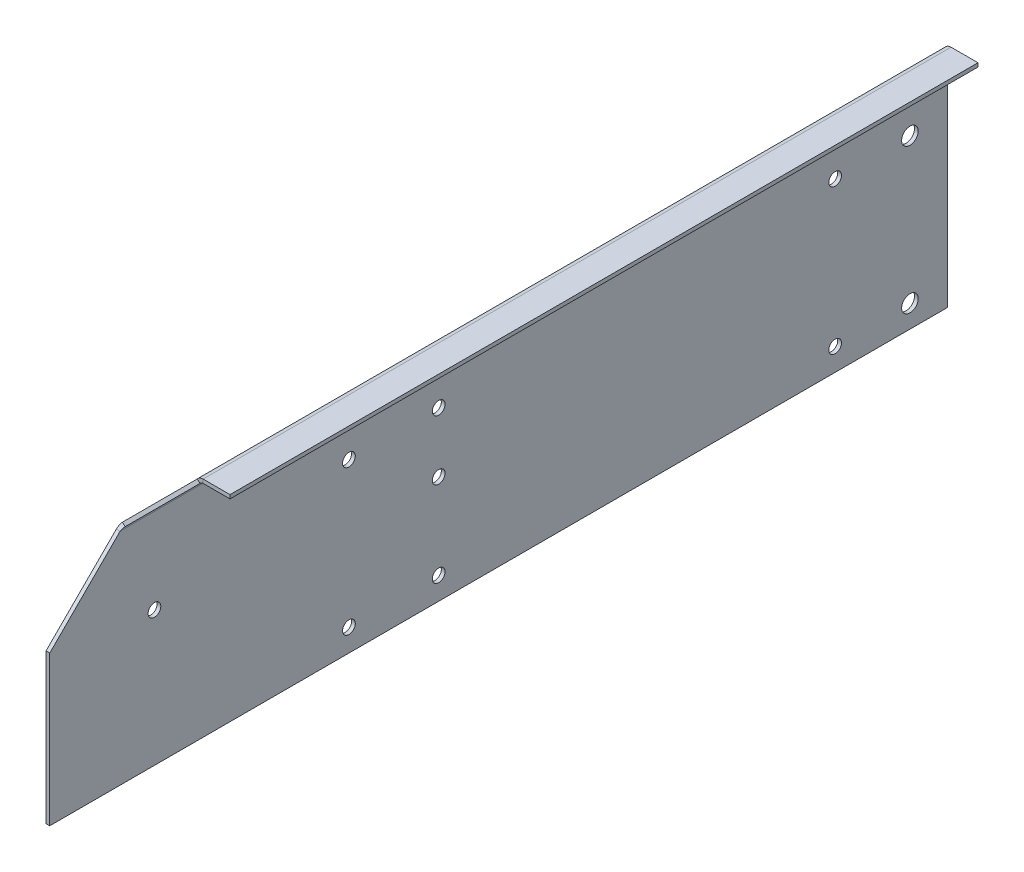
ISO-10303-21;
HEADER;
FILE_DESCRIPTION(('STEP AP214'),'2;1');
FILE_NAME('part.step','',(''),(''),'','','');
FILE_SCHEMA(('AUTOMOTIVE_DESIGN { 1 0 10303 214 1 1 1 1 }'));
ENDSEC;
DATA;
#1=APPLICATION_CONTEXT('core data for automotive mechanical design processes');
#2=APPLICATION_PROTOCOL_DEFINITION('international standard','automotive_design',2000,#1);
#3=PRODUCT_CONTEXT('',#1,'mechanical');
#4=PRODUCT('Part','Part','',(#3));
#5=PRODUCT_RELATED_PRODUCT_CATEGORY('part','',(#4));
#6=PRODUCT_DEFINITION_FORMATION('','',#4);
#7=PRODUCT_DEFINITION_CONTEXT('part definition',#1,'design');
#8=PRODUCT_DEFINITION('design','',#6,#7);
#9=PRODUCT_DEFINITION_SHAPE('','',#8);
#10=(LENGTH_UNIT() NAMED_UNIT(*) SI_UNIT(.MILLI.,.METRE.));
#11=(NAMED_UNIT(*) PLANE_ANGLE_UNIT() SI_UNIT($,.RADIAN.));
#12=(NAMED_UNIT(*) SI_UNIT($,.STERADIAN.) SOLID_ANGLE_UNIT());
#13=UNCERTAINTY_MEASURE_WITH_UNIT(LENGTH_MEASURE(1.E-05),#10,'distance_accuracy_value','');
#14=(GEOMETRIC_REPRESENTATION_CONTEXT(3) GLOBAL_UNCERTAINTY_ASSIGNED_CONTEXT((#13)) GLOBAL_UNIT_ASSIGNED_CONTEXT((#10,
#11,#12)) REPRESENTATION_CONTEXT('',''));
#15=CARTESIAN_POINT('',(0.,0.,0.));
#16=DIRECTION('',(0.,0.,1.));
#17=DIRECTION('',(1.,0.,0.));
#18=AXIS2_PLACEMENT_3D('',#15,#16,#17);
#19=CARTESIAN_POINT('',(5.,147.,300.));
#20=DIRECTION('',(0.,0.,-1.));
#21=DIRECTION('',(-1.,0.,0.));
#22=AXIS2_PLACEMENT_3D('',#19,#20,#21);
#23=CYLINDRICAL_SURFACE('',#22,5.);
#24=DIRECTION('',(0.,0.,-1.));
#25=VECTOR('',#24,1.);
#26=CARTESIAN_POINT('',(0.,147.,300.));
#27=LINE('',#26,#25);
#28=CARTESIAN_POINT('',(0.,147.,253.));
#29=VERTEX_POINT('',#28);
#30=CARTESIAN_POINT('',(0.,147.,-300.));
#31=VERTEX_POINT('',#30);
#32=EDGE_CURVE('E175',#29,#31,#27,.T.);
#33=ORIENTED_EDGE('',*,*,#32,.F.);
#34=CARTESIAN_POINT('',(5.,147.,253.));
#35=DIRECTION('',(0.,-0.707106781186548,-0.707106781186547));
#36=DIRECTION('',(0.,0.707106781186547,-0.707106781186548));
#37=AXIS2_PLACEMENT_3D('',#34,#35,#36);
#38=ELLIPSE('',#37,7.07106781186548,5.);
#39=CARTESIAN_POINT('',(0.999999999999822,150.,250.));
#40=VERTEX_POINT('',#39);
#41=EDGE_CURVE('E188',#40,#29,#38,.F.);
#42=ORIENTED_EDGE('',*,*,#41,.F.);
#43=DIRECTION('',(0.,0.,-1.));
#44=VECTOR('',#43,1.);
#45=CARTESIAN_POINT('',(0.999999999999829,150.,300.));
#46=LINE('',#45,#44);
#47=CARTESIAN_POINT('',(0.999999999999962,150.,200.));
#48=VERTEX_POINT('',#47);
#49=EDGE_CURVE('E291',#48,#40,#46,.F.);
#50=ORIENTED_EDGE('',*,*,#49,.F.);
#51=CARTESIAN_POINT('',(5.,147.,200.));
#52=DIRECTION('',(0.,0.,-1.));
#53=DIRECTION('',(-1.,0.,0.));
#54=AXIS2_PLACEMENT_3D('',#51,#52,#53);
#55=CIRCLE('',#54,5.);
#56=CARTESIAN_POINT('',(5.,152.,200.));
#57=VERTEX_POINT('',#56);
#58=EDGE_CURVE('E301',#57,#48,#55,.F.);
#59=ORIENTED_EDGE('',*,*,#58,.F.);
#60=DIRECTION('',(0.,0.,-1.));
#61=VECTOR('',#60,1.);
#62=CARTESIAN_POINT('',(5.00000000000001,152.,300.));
#63=LINE('',#62,#61);
#64=CARTESIAN_POINT('',(5.00000000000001,152.,-300.));
#65=VERTEX_POINT('',#64);
#66=EDGE_CURVE('E178',#57,#65,#63,.T.);
#67=ORIENTED_EDGE('',*,*,#66,.T.);
#68=CARTESIAN_POINT('',(5.,147.,-300.));
#69=DIRECTION('',(0.,0.,1.));
#70=DIRECTION('',(1.,0.,0.));
#71=AXIS2_PLACEMENT_3D('',#68,#69,#70);
#72=CIRCLE('',#71,5.);
#73=EDGE_CURVE('E122',#31,#65,#72,.F.);
#74=ORIENTED_EDGE('',*,*,#73,.F.);
#75=EDGE_LOOP('',(#33,#42,#50,#59,#67,#74));
#76=FACE_BOUND('',#75,.T.);
#77=ADVANCED_FACE('F40',(#76),#23,.T.);
#78=CARTESIAN_POINT('',(5.,147.,300.));
#79=DIRECTION('',(0.,0.,-1.));
#80=DIRECTION('',(-1.,0.,0.));
#81=AXIS2_PLACEMENT_3D('',#78,#79,#80);
#82=CYLINDRICAL_SURFACE('',#81,2.5);
#83=CARTESIAN_POINT('',(5.,147.,253.));
#84=DIRECTION('',(0.,-0.894427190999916,-0.447213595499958));
#85=DIRECTION('',(0.,0.447213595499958,-0.894427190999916));
#86=AXIS2_PLACEMENT_3D('',#83,#84,#85);
#87=ELLIPSE('',#86,5.59016994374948,2.5);
#88=CARTESIAN_POINT('',(2.99999999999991,148.5,250.));
#89=VERTEX_POINT('',#88);
#90=CARTESIAN_POINT('',(2.5,147.,253.));
#91=VERTEX_POINT('',#90);
#92=EDGE_CURVE('E58',#89,#91,#87,.F.);
#93=ORIENTED_EDGE('',*,*,#92,.T.);
#94=DIRECTION('',(0.,0.,-1.));
#95=VECTOR('',#94,1.);
#96=CARTESIAN_POINT('',(2.5,147.,300.));
#97=LINE('',#96,#95);
#98=CARTESIAN_POINT('',(2.5,147.,-300.));
#99=VERTEX_POINT('',#98);
#100=EDGE_CURVE('E112',#91,#99,#97,.T.);
#101=ORIENTED_EDGE('',*,*,#100,.T.);
#102=CARTESIAN_POINT('',(5.,147.,-300.));
#103=DIRECTION('',(0.,0.,1.));
#104=DIRECTION('',(1.,0.,0.));
#105=AXIS2_PLACEMENT_3D('',#102,#103,#104);
#106=CIRCLE('',#105,2.5);
#107=CARTESIAN_POINT('',(5.,149.5,-300.));
#108=VERTEX_POINT('',#107);
#109=EDGE_CURVE('E120',#99,#108,#106,.F.);
#110=ORIENTED_EDGE('',*,*,#109,.T.);
#111=DIRECTION('',(0.,0.,-1.));
#112=VECTOR('',#111,1.);
#113=CARTESIAN_POINT('',(5.,149.5,300.));
#114=LINE('',#113,#112);
#115=CARTESIAN_POINT('',(5.,149.5,200.));
#116=VERTEX_POINT('',#115);
#117=EDGE_CURVE('E99',#116,#108,#114,.T.);
#118=ORIENTED_EDGE('',*,*,#117,.F.);
#119=CARTESIAN_POINT('',(5.,147.,200.));
#120=DIRECTION('',(0.,0.,-1.));
#121=DIRECTION('',(-1.,0.,0.));
#122=AXIS2_PLACEMENT_3D('',#119,#120,#121);
#123=CIRCLE('',#122,2.5);
#124=CARTESIAN_POINT('',(2.99999999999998,148.5,200.));
#125=VERTEX_POINT('',#124);
#126=EDGE_CURVE('E302',#116,#125,#123,.F.);
#127=ORIENTED_EDGE('',*,*,#126,.T.);
#128=DIRECTION('',(0.,0.,-1.));
#129=VECTOR('',#128,1.);
#130=CARTESIAN_POINT('',(2.99999999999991,148.5,300.));
#131=LINE('',#130,#129);
#132=EDGE_CURVE('E290',#125,#89,#131,.F.);
#133=ORIENTED_EDGE('',*,*,#132,.T.);
#134=EDGE_LOOP('',(#93,#101,#110,#118,#127,#133));
#135=FACE_BOUND('',#134,.T.);
#136=ADVANCED_FACE('F129',(#135),#82,.F.);
#137=CARTESIAN_POINT('',(0.,0.,300.));
#138=DIRECTION('',(-1.,0.,0.));
#139=DIRECTION('',(0.,0.,1.));
#140=AXIS2_PLACEMENT_3D('',#137,#138,#139);
#141=PLANE('',#140);
#142=CARTESIAN_POINT('',(0.,15.,-275.));
#143=DIRECTION('',(-1.,0.,0.));
#144=DIRECTION('',(0.,0.,1.));
#145=AXIS2_PLACEMENT_3D('',#142,#143,#144);
#146=CIRCLE('',#145,5.54999999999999);
#147=CARTESIAN_POINT('',(0.,15.,-269.45));
#148=VERTEX_POINT('',#147);
#149=EDGE_CURVE('E205',#148,#148,#146,.T.);
#150=ORIENTED_EDGE('',*,*,#149,.F.);
#151=EDGE_LOOP('',(#150));
#152=FACE_BOUND('',#151,.T.);
#153=CARTESIAN_POINT('',(0.,112.,-275.));
#154=DIRECTION('',(-1.,0.,0.));
#155=DIRECTION('',(0.,0.,1.));
#156=AXIS2_PLACEMENT_3D('',#153,#154,#155);
#157=CIRCLE('',#156,5.54999999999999);
#158=CARTESIAN_POINT('',(0.,112.,-269.45));
#159=VERTEX_POINT('',#158);
#160=EDGE_CURVE('E189',#159,#159,#157,.T.);
#161=ORIENTED_EDGE('',*,*,#160,.F.);
#162=EDGE_LOOP('',(#161));
#163=FACE_BOUND('',#162,.T.);
#164=CARTESIAN_POINT('',(0.,90.,230.));
#165=DIRECTION('',(-1.,0.,0.));
#166=DIRECTION('',(0.,0.,1.));
#167=AXIS2_PLACEMENT_3D('',#164,#165,#166);
#168=CIRCLE('',#167,4.25000000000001);
#169=CARTESIAN_POINT('',(0.,90.,234.25));
#170=VERTEX_POINT('',#169);
#171=EDGE_CURVE('E282',#170,#170,#168,.T.);
#172=ORIENTED_EDGE('',*,*,#171,.F.);
#173=EDGE_LOOP('',(#172));
#174=FACE_BOUND('',#173,.T.);
#175=CARTESIAN_POINT('',(0.,72.,40.));
#176=DIRECTION('',(-1.,0.,0.));
#177=DIRECTION('',(0.,0.,1.));
#178=AXIS2_PLACEMENT_3D('',#175,#176,#177);
#179=CIRCLE('',#178,4.25000000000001);
#180=CARTESIAN_POINT('',(0.,72.,44.25));
#181=VERTEX_POINT('',#180);
#182=EDGE_CURVE('E274',#181,#181,#179,.T.);
#183=ORIENTED_EDGE('',*,*,#182,.F.);
#184=EDGE_LOOP('',(#183));
#185=FACE_BOUND('',#184,.T.);
#186=CARTESIAN_POINT('',(0.,15.,100.));
#187=DIRECTION('',(-1.,0.,0.));
#188=DIRECTION('',(0.,0.,1.));
#189=AXIS2_PLACEMENT_3D('',#186,#187,#188);
#190=CIRCLE('',#189,4.25);
#191=CARTESIAN_POINT('',(0.,15.,104.25));
#192=VERTEX_POINT('',#191);
#193=EDGE_CURVE('E266',#192,#192,#190,.T.);
#194=ORIENTED_EDGE('',*,*,#193,.F.);
#195=EDGE_LOOP('',(#194));
#196=FACE_BOUND('',#195,.T.);
#197=CARTESIAN_POINT('',(0.,15.,-225.));
#198=DIRECTION('',(-1.,0.,0.));
#199=DIRECTION('',(0.,0.,1.));
#200=AXIS2_PLACEMENT_3D('',#197,#198,#199);
#201=CIRCLE('',#200,4.24999999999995);
#202=CARTESIAN_POINT('',(0.,15.,-220.75));
#203=VERTEX_POINT('',#202);
#204=EDGE_CURVE('E258',#203,#203,#201,.T.);
#205=ORIENTED_EDGE('',*,*,#204,.F.);
#206=EDGE_LOOP('',(#205));
#207=FACE_BOUND('',#206,.T.);
#208=CARTESIAN_POINT('',(0.,112.,40.));
#209=DIRECTION('',(-1.,0.,0.));
#210=DIRECTION('',(0.,0.,1.));
#211=AXIS2_PLACEMENT_3D('',#208,#209,#210);
#212=CIRCLE('',#211,4.25000000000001);
#213=CARTESIAN_POINT('',(0.,112.,44.25));
#214=VERTEX_POINT('',#213);
#215=EDGE_CURVE('E250',#214,#214,#212,.T.);
#216=ORIENTED_EDGE('',*,*,#215,.F.);
#217=EDGE_LOOP('',(#216));
#218=FACE_BOUND('',#217,.T.);
#219=CARTESIAN_POINT('',(0.,15.,40.));
#220=DIRECTION('',(-1.,0.,0.));
#221=DIRECTION('',(0.,0.,1.));
#222=AXIS2_PLACEMENT_3D('',#219,#220,#221);
#223=CIRCLE('',#222,4.25);
#224=CARTESIAN_POINT('',(0.,15.,44.25));
#225=VERTEX_POINT('',#224);
#226=EDGE_CURVE('E243',#225,#225,#223,.T.);
#227=ORIENTED_EDGE('',*,*,#226,.F.);
#228=EDGE_LOOP('',(#227));
#229=FACE_BOUND('',#228,.T.);
#230=CARTESIAN_POINT('',(0.,112.,-225.));
#231=DIRECTION('',(-1.,0.,0.));
#232=DIRECTION('',(0.,0.,1.));
#233=AXIS2_PLACEMENT_3D('',#230,#231,#232);
#234=CIRCLE('',#233,4.24999999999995);
#235=CARTESIAN_POINT('',(0.,112.,-220.75));
#236=VERTEX_POINT('',#235);
#237=EDGE_CURVE('E235',#236,#236,#234,.T.);
#238=ORIENTED_EDGE('',*,*,#237,.F.);
#239=EDGE_LOOP('',(#238));
#240=FACE_BOUND('',#239,.T.);
#241=CARTESIAN_POINT('',(0.,112.,100.));
#242=DIRECTION('',(-1.,0.,0.));
#243=DIRECTION('',(0.,0.,1.));
#244=AXIS2_PLACEMENT_3D('',#241,#242,#243);
#245=CIRCLE('',#244,4.25000000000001);
#246=CARTESIAN_POINT('',(0.,112.,104.25));
#247=VERTEX_POINT('',#246);
#248=EDGE_CURVE('E224',#247,#247,#245,.T.);
#249=ORIENTED_EDGE('',*,*,#248,.F.);
#250=EDGE_LOOP('',(#249));
#251=FACE_BOUND('',#250,.T.);
#252=DIRECTION('',(0.,1.,0.));
#253=VECTOR('',#252,1.);
#254=CARTESIAN_POINT('',(0.,0.,300.));
#255=LINE('',#254,#253);
#256=CARTESIAN_POINT('',(0.,0.,300.));
#257=VERTEX_POINT('',#256);
#258=CARTESIAN_POINT('',(0.,99.9999999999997,300.));
#259=VERTEX_POINT('',#258);
#260=EDGE_CURVE('E132',#257,#259,#255,.T.);
#261=ORIENTED_EDGE('',*,*,#260,.T.);
#262=DIRECTION('',(0.,-0.707106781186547,0.707106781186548));
#263=VECTOR('',#262,1.);
#264=CARTESIAN_POINT('',(0.,49.9999999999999,350.));
#265=LINE('',#264,#263);
#266=EDGE_CURVE('E213',#29,#259,#265,.T.);
#267=ORIENTED_EDGE('',*,*,#266,.F.);
#268=ORIENTED_EDGE('',*,*,#32,.T.);
#269=DIRECTION('',(0.,1.,0.));
#270=VECTOR('',#269,1.);
#271=CARTESIAN_POINT('',(0.,0.,-300.));
#272=LINE('',#271,#270);
#273=CARTESIAN_POINT('',(0.,0.,-300.));
#274=VERTEX_POINT('',#273);
#275=EDGE_CURVE('E157',#274,#31,#272,.T.);
#276=ORIENTED_EDGE('',*,*,#275,.F.);
#277=DIRECTION('',(0.,0.,-1.));
#278=VECTOR('',#277,1.);
#279=CARTESIAN_POINT('',(0.,0.,300.));
#280=LINE('',#279,#278);
#281=EDGE_CURVE('E172',#257,#274,#280,.T.);
#282=ORIENTED_EDGE('',*,*,#281,.F.);
#283=EDGE_LOOP('',(#261,#267,#268,#276,#282));
#284=FACE_BOUND('',#283,.T.);
#285=ADVANCED_FACE('F379',(#152,#163,#174,#185,#196,#207,#218,#229,#240,#251,#284),#141,.T.);
#286=CARTESIAN_POINT('',(2.5,0.,300.));
#287=DIRECTION('',(-1.,0.,0.));
#288=DIRECTION('',(0.,0.,1.));
#289=AXIS2_PLACEMENT_3D('',#286,#287,#288);
#290=PLANE('',#289);
#291=CARTESIAN_POINT('',(2.5,15.,-275.));
#292=DIRECTION('',(-1.,0.,0.));
#293=DIRECTION('',(0.,0.,1.));
#294=AXIS2_PLACEMENT_3D('',#291,#292,#293);
#295=CIRCLE('',#294,5.54999999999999);
#296=CARTESIAN_POINT('',(2.5,15.,-269.45));
#297=VERTEX_POINT('',#296);
#298=EDGE_CURVE('E44',#297,#297,#295,.T.);
#299=ORIENTED_EDGE('',*,*,#298,.T.);
#300=EDGE_LOOP('',(#299));
#301=FACE_BOUND('',#300,.T.);
#302=CARTESIAN_POINT('',(2.5,112.,-275.));
#303=DIRECTION('',(-1.,0.,0.));
#304=DIRECTION('',(0.,0.,1.));
#305=AXIS2_PLACEMENT_3D('',#302,#303,#304);
#306=CIRCLE('',#305,5.54999999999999);
#307=CARTESIAN_POINT('',(2.5,112.,-269.45));
#308=VERTEX_POINT('',#307);
#309=EDGE_CURVE('E185',#308,#308,#306,.T.);
#310=ORIENTED_EDGE('',*,*,#309,.T.);
#311=EDGE_LOOP('',(#310));
#312=FACE_BOUND('',#311,.T.);
#313=CARTESIAN_POINT('',(2.5,90.,230.));
#314=DIRECTION('',(-1.,0.,0.));
#315=DIRECTION('',(0.,0.,1.));
#316=AXIS2_PLACEMENT_3D('',#313,#314,#315);
#317=CIRCLE('',#316,4.25000000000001);
#318=CARTESIAN_POINT('',(2.5,90.,234.25));
#319=VERTEX_POINT('',#318);
#320=EDGE_CURVE('E286',#319,#319,#317,.F.);
#321=ORIENTED_EDGE('',*,*,#320,.F.);
#322=EDGE_LOOP('',(#321));
#323=FACE_BOUND('',#322,.T.);
#324=CARTESIAN_POINT('',(2.5,72.,40.));
#325=DIRECTION('',(-1.,0.,0.));
#326=DIRECTION('',(0.,0.,1.));
#327=AXIS2_PLACEMENT_3D('',#324,#325,#326);
#328=CIRCLE('',#327,4.25000000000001);
#329=CARTESIAN_POINT('',(2.5,72.,44.25));
#330=VERTEX_POINT('',#329);
#331=EDGE_CURVE('E278',#330,#330,#328,.F.);
#332=ORIENTED_EDGE('',*,*,#331,.F.);
#333=EDGE_LOOP('',(#332));
#334=FACE_BOUND('',#333,.T.);
#335=CARTESIAN_POINT('',(2.5,15.,100.));
#336=DIRECTION('',(-1.,0.,0.));
#337=DIRECTION('',(0.,0.,1.));
#338=AXIS2_PLACEMENT_3D('',#335,#336,#337);
#339=CIRCLE('',#338,4.25);
#340=CARTESIAN_POINT('',(2.5,15.,104.25));
#341=VERTEX_POINT('',#340);
#342=EDGE_CURVE('E270',#341,#341,#339,.F.);
#343=ORIENTED_EDGE('',*,*,#342,.F.);
#344=EDGE_LOOP('',(#343));
#345=FACE_BOUND('',#344,.T.);
#346=CARTESIAN_POINT('',(2.5,15.,-225.));
#347=DIRECTION('',(-1.,0.,0.));
#348=DIRECTION('',(0.,0.,1.));
#349=AXIS2_PLACEMENT_3D('',#346,#347,#348);
#350=CIRCLE('',#349,4.24999999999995);
#351=CARTESIAN_POINT('',(2.5,15.,-220.75));
#352=VERTEX_POINT('',#351);
#353=EDGE_CURVE('E262',#352,#352,#350,.F.);
#354=ORIENTED_EDGE('',*,*,#353,.F.);
#355=EDGE_LOOP('',(#354));
#356=FACE_BOUND('',#355,.T.);
#357=CARTESIAN_POINT('',(2.5,112.,40.));
#358=DIRECTION('',(-1.,0.,0.));
#359=DIRECTION('',(0.,0.,1.));
#360=AXIS2_PLACEMENT_3D('',#357,#358,#359);
#361=CIRCLE('',#360,4.25000000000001);
#362=CARTESIAN_POINT('',(2.5,112.,44.25));
#363=VERTEX_POINT('',#362);
#364=EDGE_CURVE('E254',#363,#363,#361,.F.);
#365=ORIENTED_EDGE('',*,*,#364,.F.);
#366=EDGE_LOOP('',(#365));
#367=FACE_BOUND('',#366,.T.);
#368=CARTESIAN_POINT('',(2.5,15.,40.));
#369=DIRECTION('',(-1.,0.,0.));
#370=DIRECTION('',(0.,0.,1.));
#371=AXIS2_PLACEMENT_3D('',#368,#369,#370);
#372=CIRCLE('',#371,4.25);
#373=CARTESIAN_POINT('',(2.5,15.,44.25));
#374=VERTEX_POINT('',#373);
#375=EDGE_CURVE('E247',#374,#374,#372,.F.);
#376=ORIENTED_EDGE('',*,*,#375,.F.);
#377=EDGE_LOOP('',(#376));
#378=FACE_BOUND('',#377,.T.);
#379=CARTESIAN_POINT('',(2.5,112.,-225.));
#380=DIRECTION('',(-1.,0.,0.));
#381=DIRECTION('',(0.,0.,1.));
#382=AXIS2_PLACEMENT_3D('',#379,#380,#381);
#383=CIRCLE('',#382,4.24999999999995);
#384=CARTESIAN_POINT('',(2.5,112.,-220.75));
#385=VERTEX_POINT('',#384);
#386=EDGE_CURVE('E239',#385,#385,#383,.F.);
#387=ORIENTED_EDGE('',*,*,#386,.F.);
#388=EDGE_LOOP('',(#387));
#389=FACE_BOUND('',#388,.T.);
#390=CARTESIAN_POINT('',(2.5,112.,100.));
#391=DIRECTION('',(-1.,0.,0.));
#392=DIRECTION('',(0.,0.,1.));
#393=AXIS2_PLACEMENT_3D('',#390,#391,#392);
#394=CIRCLE('',#393,4.25000000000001);
#395=CARTESIAN_POINT('',(2.5,112.,104.25));
#396=VERTEX_POINT('',#395);
#397=EDGE_CURVE('E231',#396,#396,#394,.F.);
#398=ORIENTED_EDGE('',*,*,#397,.F.);
#399=EDGE_LOOP('',(#398));
#400=FACE_BOUND('',#399,.T.);
#401=DIRECTION('',(0.,-0.707106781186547,0.707106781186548));
#402=VECTOR('',#401,1.);
#403=CARTESIAN_POINT('',(2.5,49.9999999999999,350.));
#404=LINE('',#403,#402);
#405=CARTESIAN_POINT('',(2.5,99.9999999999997,300.));
#406=VERTEX_POINT('',#405);
#407=EDGE_CURVE('E212',#91,#406,#404,.T.);
#408=ORIENTED_EDGE('',*,*,#407,.T.);
#409=DIRECTION('',(0.,1.,0.));
#410=VECTOR('',#409,1.);
#411=CARTESIAN_POINT('',(2.5,0.,300.));
#412=LINE('',#411,#410);
#413=CARTESIAN_POINT('',(2.5,0.,300.));
#414=VERTEX_POINT('',#413);
#415=EDGE_CURVE('E113',#414,#406,#412,.T.);
#416=ORIENTED_EDGE('',*,*,#415,.F.);
#417=DIRECTION('',(0.,0.,-1.));
#418=VECTOR('',#417,1.);
#419=CARTESIAN_POINT('',(2.5,0.,300.));
#420=LINE('',#419,#418);
#421=CARTESIAN_POINT('',(2.5,0.,-300.));
#422=VERTEX_POINT('',#421);
#423=EDGE_CURVE('E67',#414,#422,#420,.T.);
#424=ORIENTED_EDGE('',*,*,#423,.T.);
#425=DIRECTION('',(0.,1.,0.));
#426=VECTOR('',#425,1.);
#427=CARTESIAN_POINT('',(2.5,0.,-300.));
#428=LINE('',#427,#426);
#429=EDGE_CURVE('E133',#422,#99,#428,.T.);
#430=ORIENTED_EDGE('',*,*,#429,.T.);
#431=ORIENTED_EDGE('',*,*,#100,.F.);
#432=EDGE_LOOP('',(#408,#416,#424,#430,#431));
#433=FACE_BOUND('',#432,.T.);
#434=ADVANCED_FACE('F333',(#301,#312,#323,#334,#345,#356,#367,#378,#389,#400,#433),#290,.F.);
#435=CARTESIAN_POINT('',(5.,147.,300.));
#436=DIRECTION('',(0.,0.,1.));
#437=DIRECTION('',(1.,0.,0.));
#438=AXIS2_PLACEMENT_3D('',#435,#436,#437);
#439=PLANE('',#438);
#440=ORIENTED_EDGE('',*,*,#415,.T.);
#441=DIRECTION('',(1.,0.,0.));
#442=VECTOR('',#441,1.);
#443=CARTESIAN_POINT('',(2.5,99.9999999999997,300.));
#444=LINE('',#443,#442);
#445=EDGE_CURVE('E221',#406,#259,#444,.F.);
#446=ORIENTED_EDGE('',*,*,#445,.T.);
#447=ORIENTED_EDGE('',*,*,#260,.F.);
#448=DIRECTION('',(-1.,0.,0.));
#449=VECTOR('',#448,1.);
#450=CARTESIAN_POINT('',(2.5,0.,300.));
#451=LINE('',#450,#449);
#452=EDGE_CURVE('E318',#414,#257,#451,.T.);
#453=ORIENTED_EDGE('',*,*,#452,.F.);
#454=EDGE_LOOP('',(#440,#446,#447,#453));
#455=FACE_BOUND('',#454,.T.);
#456=ADVANCED_FACE('F325',(#455),#439,.T.);
#457=CARTESIAN_POINT('',(2.99999999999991,148.5,250.));
#458=DIRECTION('',(0.599999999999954,0.800000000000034,0.));
#459=DIRECTION('',(0.,0.,-1.));
#460=AXIS2_PLACEMENT_3D('',#457,#458,#459);
#461=PLANE('',#460);
#462=ORIENTED_EDGE('',*,*,#49,.T.);
#463=DIRECTION('',(-0.800000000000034,0.599999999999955,0.));
#464=VECTOR('',#463,1.);
#465=CARTESIAN_POINT('',(0.999999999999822,150.,250.));
#466=LINE('',#465,#464);
#467=EDGE_CURVE('E208',#40,#89,#466,.F.);
#468=ORIENTED_EDGE('',*,*,#467,.T.);
#469=ORIENTED_EDGE('',*,*,#132,.F.);
#470=DIRECTION('',(0.800000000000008,-0.59999999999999,0.));
#471=VECTOR('',#470,1.);
#472=CARTESIAN_POINT('',(2.99999999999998,148.5,200.));
#473=LINE('',#472,#471);
#474=EDGE_CURVE('E295',#125,#48,#473,.F.);
#475=ORIENTED_EDGE('',*,*,#474,.T.);
#476=EDGE_LOOP('',(#462,#468,#469,#475));
#477=FACE_BOUND('',#476,.T.);
#478=ADVANCED_FACE('F345',(#477),#461,.T.);
#479=CARTESIAN_POINT('',(0.,149.5,300.));
#480=DIRECTION('',(0.,1.,0.));
#481=DIRECTION('',(-1.,0.,0.));
#482=AXIS2_PLACEMENT_3D('',#479,#480,#481);
#483=PLANE('',#482);
#484=DIRECTION('',(-1.,0.,0.));
#485=VECTOR('',#484,1.);
#486=CARTESIAN_POINT('',(0.,149.5,200.));
#487=LINE('',#486,#485);
#488=CARTESIAN_POINT('',(23.,149.5,200.));
#489=VERTEX_POINT('',#488);
#490=EDGE_CURVE('E107',#489,#116,#487,.T.);
#491=ORIENTED_EDGE('',*,*,#490,.T.);
#492=ORIENTED_EDGE('',*,*,#117,.T.);
#493=DIRECTION('',(1.,0.,0.));
#494=VECTOR('',#493,1.);
#495=CARTESIAN_POINT('',(0.,149.5,-300.));
#496=LINE('',#495,#494);
#497=CARTESIAN_POINT('',(23.,149.5,-300.));
#498=VERTEX_POINT('',#497);
#499=EDGE_CURVE('E104',#108,#498,#496,.T.);
#500=ORIENTED_EDGE('',*,*,#499,.T.);
#501=DIRECTION('',(0.,0.,-1.));
#502=VECTOR('',#501,1.);
#503=CARTESIAN_POINT('',(23.,149.5,300.));
#504=LINE('',#503,#502);
#505=EDGE_CURVE('E127',#489,#498,#504,.T.);
#506=ORIENTED_EDGE('',*,*,#505,.F.);
#507=EDGE_LOOP('',(#491,#492,#500,#506));
#508=FACE_BOUND('',#507,.T.);
#509=ADVANCED_FACE('F101',(#508),#483,.F.);
#510=CARTESIAN_POINT('',(23.,152.,300.));
#511=DIRECTION('',(1.,0.,0.));
#512=DIRECTION('',(0.,1.,0.));
#513=AXIS2_PLACEMENT_3D('',#510,#511,#512);
#514=PLANE('',#513);
#515=DIRECTION('',(0.,0.,-1.));
#516=VECTOR('',#515,1.);
#517=CARTESIAN_POINT('',(23.,152.,300.));
#518=LINE('',#517,#516);
#519=CARTESIAN_POINT('',(23.,152.,200.));
#520=VERTEX_POINT('',#519);
#521=CARTESIAN_POINT('',(23.,152.,-300.));
#522=VERTEX_POINT('',#521);
#523=EDGE_CURVE('E181',#520,#522,#518,.T.);
#524=ORIENTED_EDGE('',*,*,#523,.F.);
#525=DIRECTION('',(0.,1.,0.));
#526=VECTOR('',#525,1.);
#527=CARTESIAN_POINT('',(23.,152.,200.));
#528=LINE('',#527,#526);
#529=EDGE_CURVE('E148',#520,#489,#528,.F.);
#530=ORIENTED_EDGE('',*,*,#529,.T.);
#531=ORIENTED_EDGE('',*,*,#505,.T.);
#532=DIRECTION('',(0.,-1.,0.));
#533=VECTOR('',#532,1.);
#534=CARTESIAN_POINT('',(23.,152.,-300.));
#535=LINE('',#534,#533);
#536=EDGE_CURVE('E137',#522,#498,#535,.T.);
#537=ORIENTED_EDGE('',*,*,#536,.F.);
#538=EDGE_LOOP('',(#524,#530,#531,#537));
#539=FACE_BOUND('',#538,.T.);
#540=ADVANCED_FACE('F366',(#539),#514,.T.);
#541=CARTESIAN_POINT('',(0.,152.,300.));
#542=DIRECTION('',(0.,1.,0.));
#543=DIRECTION('',(-1.,0.,0.));
#544=AXIS2_PLACEMENT_3D('',#541,#542,#543);
#545=PLANE('',#544);
#546=ORIENTED_EDGE('',*,*,#66,.F.);
#547=DIRECTION('',(-1.,0.,0.));
#548=VECTOR('',#547,1.);
#549=CARTESIAN_POINT('',(23.,152.,200.));
#550=LINE('',#549,#548);
#551=EDGE_CURVE('E305',#520,#57,#550,.T.);
#552=ORIENTED_EDGE('',*,*,#551,.F.);
#553=ORIENTED_EDGE('',*,*,#523,.T.);
#554=DIRECTION('',(1.,0.,0.));
#555=VECTOR('',#554,1.);
#556=CARTESIAN_POINT('',(0.,152.,-300.));
#557=LINE('',#556,#555);
#558=EDGE_CURVE('E144',#65,#522,#557,.T.);
#559=ORIENTED_EDGE('',*,*,#558,.F.);
#560=EDGE_LOOP('',(#546,#552,#553,#559));
#561=FACE_BOUND('',#560,.T.);
#562=ADVANCED_FACE('F363',(#561),#545,.T.);
#563=CARTESIAN_POINT('',(0.,147.,-300.));
#564=DIRECTION('',(0.,0.,-1.));
#565=DIRECTION('',(-1.,0.,0.));
#566=AXIS2_PLACEMENT_3D('',#563,#564,#565);
#567=PLANE('',#566);
#568=DIRECTION('',(1.,0.,0.));
#569=VECTOR('',#568,1.);
#570=CARTESIAN_POINT('',(0.,147.,-300.));
#571=LINE('',#570,#569);
#572=EDGE_CURVE('E11',#31,#99,#571,.T.);
#573=ORIENTED_EDGE('',*,*,#572,.F.);
#574=ORIENTED_EDGE('',*,*,#73,.T.);
#575=DIRECTION('',(0.,1.,0.));
#576=VECTOR('',#575,1.);
#577=CARTESIAN_POINT('',(5.,149.5,-300.));
#578=LINE('',#577,#576);
#579=EDGE_CURVE('E50',#108,#65,#578,.T.);
#580=ORIENTED_EDGE('',*,*,#579,.F.);
#581=ORIENTED_EDGE('',*,*,#109,.F.);
#582=EDGE_LOOP('',(#573,#574,#580,#581));
#583=FACE_BOUND('',#582,.T.);
#584=ADVANCED_FACE('F42',(#583),#567,.T.);
#585=CARTESIAN_POINT('',(5.,149.5,-300.));
#586=DIRECTION('',(0.,0.,-1.));
#587=DIRECTION('',(-1.,0.,0.));
#588=AXIS2_PLACEMENT_3D('',#585,#586,#587);
#589=PLANE('',#588);
#590=ORIENTED_EDGE('',*,*,#275,.T.);
#591=ORIENTED_EDGE('',*,*,#572,.T.);
#592=ORIENTED_EDGE('',*,*,#429,.F.);
#593=DIRECTION('',(-1.,0.,0.));
#594=VECTOR('',#593,1.);
#595=CARTESIAN_POINT('',(2.5,0.,-300.));
#596=LINE('',#595,#594);
#597=EDGE_CURVE('E161',#422,#274,#596,.T.);
#598=ORIENTED_EDGE('',*,*,#597,.T.);
#599=EDGE_LOOP('',(#590,#591,#592,#598));
#600=FACE_BOUND('',#599,.T.);
#601=ADVANCED_FACE('F381',(#600),#589,.T.);
#602=CARTESIAN_POINT('',(2.5,0.,300.));
#603=DIRECTION('',(0.,-1.,0.));
#604=DIRECTION('',(0.,0.,-1.));
#605=AXIS2_PLACEMENT_3D('',#602,#603,#604);
#606=PLANE('',#605);
#607=ORIENTED_EDGE('',*,*,#597,.F.);
#608=ORIENTED_EDGE('',*,*,#423,.F.);
#609=ORIENTED_EDGE('',*,*,#452,.T.);
#610=ORIENTED_EDGE('',*,*,#281,.T.);
#611=EDGE_LOOP('',(#607,#608,#609,#610));
#612=FACE_BOUND('',#611,.T.);
#613=ADVANCED_FACE('F382',(#612),#606,.T.);
#614=CARTESIAN_POINT('',(5.,147.,-300.));
#615=DIRECTION('',(0.,0.,1.));
#616=DIRECTION('',(1.,0.,0.));
#617=AXIS2_PLACEMENT_3D('',#614,#615,#616);
#618=PLANE('',#617);
#619=ORIENTED_EDGE('',*,*,#499,.F.);
#620=ORIENTED_EDGE('',*,*,#579,.T.);
#621=ORIENTED_EDGE('',*,*,#558,.T.);
#622=ORIENTED_EDGE('',*,*,#536,.T.);
#623=EDGE_LOOP('',(#619,#620,#621,#622));
#624=FACE_BOUND('',#623,.T.);
#625=ADVANCED_FACE('F135',(#624),#618,.F.);
#626=CARTESIAN_POINT('',(23.,152.,200.));
#627=DIRECTION('',(0.,0.,-1.));
#628=DIRECTION('',(-1.,0.,0.));
#629=AXIS2_PLACEMENT_3D('',#626,#627,#628);
#630=PLANE('',#629);
#631=ORIENTED_EDGE('',*,*,#551,.T.);
#632=DIRECTION('',(0.,1.,0.));
#633=VECTOR('',#632,1.);
#634=CARTESIAN_POINT('',(5.,152.,200.));
#635=LINE('',#634,#633);
#636=EDGE_CURVE('E139',#57,#116,#635,.F.);
#637=ORIENTED_EDGE('',*,*,#636,.T.);
#638=ORIENTED_EDGE('',*,*,#490,.F.);
#639=ORIENTED_EDGE('',*,*,#529,.F.);
#640=EDGE_LOOP('',(#631,#637,#638,#639));
#641=FACE_BOUND('',#640,.T.);
#642=ADVANCED_FACE('F389',(#641),#630,.F.);
#643=CARTESIAN_POINT('',(5.,147.,200.));
#644=DIRECTION('',(0.,0.,1.));
#645=DIRECTION('',(1.,0.,0.));
#646=AXIS2_PLACEMENT_3D('',#643,#644,#645);
#647=PLANE('',#646);
#648=ORIENTED_EDGE('',*,*,#636,.F.);
#649=ORIENTED_EDGE('',*,*,#58,.T.);
#650=ORIENTED_EDGE('',*,*,#474,.F.);
#651=ORIENTED_EDGE('',*,*,#126,.F.);
#652=EDGE_LOOP('',(#648,#649,#650,#651));
#653=FACE_BOUND('',#652,.T.);
#654=ADVANCED_FACE('F351',(#653),#647,.T.);
#655=CARTESIAN_POINT('',(23.001,90.,230.));
#656=DIRECTION('',(-1.,0.,0.));
#657=DIRECTION('',(0.,0.,1.));
#658=AXIS2_PLACEMENT_3D('',#655,#656,#657);
#659=CYLINDRICAL_SURFACE('',#658,4.25000000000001);
#660=ORIENTED_EDGE('',*,*,#171,.T.);
#661=EDGE_LOOP('',(#660));
#662=FACE_BOUND('',#661,.T.);
#663=ORIENTED_EDGE('',*,*,#320,.T.);
#664=EDGE_LOOP('',(#663));
#665=FACE_BOUND('',#664,.T.);
#666=ADVANCED_FACE('F415',(#662,#665),#659,.F.);
#667=CARTESIAN_POINT('',(23.001,72.,40.));
#668=DIRECTION('',(-1.,0.,0.));
#669=DIRECTION('',(0.,0.,1.));
#670=AXIS2_PLACEMENT_3D('',#667,#668,#669);
#671=CYLINDRICAL_SURFACE('',#670,4.25000000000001);
#672=ORIENTED_EDGE('',*,*,#182,.T.);
#673=EDGE_LOOP('',(#672));
#674=FACE_BOUND('',#673,.T.);
#675=ORIENTED_EDGE('',*,*,#331,.T.);
#676=EDGE_LOOP('',(#675));
#677=FACE_BOUND('',#676,.T.);
#678=ADVANCED_FACE('F472',(#674,#677),#671,.F.);
#679=CARTESIAN_POINT('',(23.001,15.,100.));
#680=DIRECTION('',(-1.,0.,0.));
#681=DIRECTION('',(0.,0.,1.));
#682=AXIS2_PLACEMENT_3D('',#679,#680,#681);
#683=CYLINDRICAL_SURFACE('',#682,4.25);
#684=ORIENTED_EDGE('',*,*,#193,.T.);
#685=EDGE_LOOP('',(#684));
#686=FACE_BOUND('',#685,.T.);
#687=ORIENTED_EDGE('',*,*,#342,.T.);
#688=EDGE_LOOP('',(#687));
#689=FACE_BOUND('',#688,.T.);
#690=ADVANCED_FACE('F469',(#686,#689),#683,.F.);
#691=CARTESIAN_POINT('',(23.001,15.,-225.));
#692=DIRECTION('',(-1.,0.,0.));
#693=DIRECTION('',(0.,0.,1.));
#694=AXIS2_PLACEMENT_3D('',#691,#692,#693);
#695=CYLINDRICAL_SURFACE('',#694,4.24999999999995);
#696=ORIENTED_EDGE('',*,*,#204,.T.);
#697=EDGE_LOOP('',(#696));
#698=FACE_BOUND('',#697,.T.);
#699=ORIENTED_EDGE('',*,*,#353,.T.);
#700=EDGE_LOOP('',(#699));
#701=FACE_BOUND('',#700,.T.);
#702=ADVANCED_FACE('F465',(#698,#701),#695,.F.);
#703=CARTESIAN_POINT('',(23.001,112.,40.));
#704=DIRECTION('',(-1.,0.,0.));
#705=DIRECTION('',(0.,0.,1.));
#706=AXIS2_PLACEMENT_3D('',#703,#704,#705);
#707=CYLINDRICAL_SURFACE('',#706,4.25000000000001);
#708=ORIENTED_EDGE('',*,*,#215,.T.);
#709=EDGE_LOOP('',(#708));
#710=FACE_BOUND('',#709,.T.);
#711=ORIENTED_EDGE('',*,*,#364,.T.);
#712=EDGE_LOOP('',(#711));
#713=FACE_BOUND('',#712,.T.);
#714=ADVANCED_FACE('F461',(#710,#713),#707,.F.);
#715=CARTESIAN_POINT('',(23.001,15.,40.));
#716=DIRECTION('',(-1.,0.,0.));
#717=DIRECTION('',(0.,0.,1.));
#718=AXIS2_PLACEMENT_3D('',#715,#716,#717);
#719=CYLINDRICAL_SURFACE('',#718,4.25);
#720=ORIENTED_EDGE('',*,*,#226,.T.);
#721=EDGE_LOOP('',(#720));
#722=FACE_BOUND('',#721,.T.);
#723=ORIENTED_EDGE('',*,*,#375,.T.);
#724=EDGE_LOOP('',(#723));
#725=FACE_BOUND('',#724,.T.);
#726=ADVANCED_FACE('F454',(#722,#725),#719,.F.);
#727=CARTESIAN_POINT('',(23.001,112.,-225.));
#728=DIRECTION('',(-1.,0.,0.));
#729=DIRECTION('',(0.,0.,1.));
#730=AXIS2_PLACEMENT_3D('',#727,#728,#729);
#731=CYLINDRICAL_SURFACE('',#730,4.24999999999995);
#732=ORIENTED_EDGE('',*,*,#237,.T.);
#733=EDGE_LOOP('',(#732));
#734=FACE_BOUND('',#733,.T.);
#735=ORIENTED_EDGE('',*,*,#386,.T.);
#736=EDGE_LOOP('',(#735));
#737=FACE_BOUND('',#736,.T.);
#738=ADVANCED_FACE('F446',(#734,#737),#731,.F.);
#739=CARTESIAN_POINT('',(23.001,112.,100.));
#740=DIRECTION('',(-1.,0.,0.));
#741=DIRECTION('',(0.,0.,1.));
#742=AXIS2_PLACEMENT_3D('',#739,#740,#741);
#743=CYLINDRICAL_SURFACE('',#742,4.25000000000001);
#744=ORIENTED_EDGE('',*,*,#248,.T.);
#745=EDGE_LOOP('',(#744));
#746=FACE_BOUND('',#745,.T.);
#747=ORIENTED_EDGE('',*,*,#397,.T.);
#748=EDGE_LOOP('',(#747));
#749=FACE_BOUND('',#748,.T.);
#750=ADVANCED_FACE('F444',(#746,#749),#743,.F.);
#751=CARTESIAN_POINT('',(2.5,49.9999999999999,350.));
#752=DIRECTION('',(0.,-0.707106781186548,-0.707106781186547));
#753=DIRECTION('',(0.,-0.707106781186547,0.707106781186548));
#754=AXIS2_PLACEMENT_3D('',#751,#752,#753);
#755=PLANE('',#754);
#756=ORIENTED_EDGE('',*,*,#445,.F.);
#757=ORIENTED_EDGE('',*,*,#407,.F.);
#758=DIRECTION('',(1.,0.,0.));
#759=VECTOR('',#758,1.);
#760=CARTESIAN_POINT('',(2.5,147.,253.));
#761=LINE('',#760,#759);
#762=EDGE_CURVE('E217',#91,#29,#761,.F.);
#763=ORIENTED_EDGE('',*,*,#762,.T.);
#764=ORIENTED_EDGE('',*,*,#266,.T.);
#765=EDGE_LOOP('',(#756,#757,#763,#764));
#766=FACE_BOUND('',#765,.T.);
#767=ADVANCED_FACE('F337',(#766),#755,.F.);
#768=CARTESIAN_POINT('',(5.,152.,248.));
#769=CARTESIAN_POINT('',(5.,151.166666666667,248.));
#770=CARTESIAN_POINT('',(5.,150.333333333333,248.));
#771=CARTESIAN_POINT('',(5.,149.5,248.));
#772=CARTESIAN_POINT('',(-5.,152.,248.));
#773=CARTESIAN_POINT('',(-3.33333333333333,151.166666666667,248.));
#774=CARTESIAN_POINT('',(-1.66666666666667,150.333333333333,248.));
#775=CARTESIAN_POINT('',(0.,149.5,248.));
#776=CARTESIAN_POINT('',(-5.,142.,258.));
#777=CARTESIAN_POINT('',(-3.33333333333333,142.833333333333,258.));
#778=CARTESIAN_POINT('',(-1.66666666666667,143.666666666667,258.));
#779=CARTESIAN_POINT('',(0.,144.5,258.));
#780=CARTESIAN_POINT('',(5.,142.,258.));
#781=CARTESIAN_POINT('',(5.,142.833333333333,258.));
#782=CARTESIAN_POINT('',(5.,143.666666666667,258.));
#783=CARTESIAN_POINT('',(5.,144.5,258.));
#784=CARTESIAN_POINT('',(15.,142.,258.));
#785=CARTESIAN_POINT('',(13.3333333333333,142.833333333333,258.));
#786=CARTESIAN_POINT('',(11.6666666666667,143.666666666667,258.));
#787=CARTESIAN_POINT('',(10.,144.5,258.));
#788=CARTESIAN_POINT('',(15.,152.,248.));
#789=CARTESIAN_POINT('',(13.3333333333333,151.166666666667,248.));
#790=CARTESIAN_POINT('',(11.6666666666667,150.333333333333,248.));
#791=CARTESIAN_POINT('',(10.,149.5,248.));
#792=CARTESIAN_POINT('',(5.,152.,248.));
#793=CARTESIAN_POINT('',(5.,151.166666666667,248.));
#794=CARTESIAN_POINT('',(5.,150.333333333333,248.));
#795=CARTESIAN_POINT('',(5.,149.5,248.));
#796=(BOUNDED_SURFACE() B_SPLINE_SURFACE(3,3,((#768,#769,#770,#771),(#772,#773,#774,#775),(#776,
#777,#778,#779),(#780,#781,#782,#783),(#784,#785,#786,#787),(#788,#789,#790,#791),(#792,#793,
#794,#795)),.UNSPECIFIED.,.T.,.F.,.F.) B_SPLINE_SURFACE_WITH_KNOTS((4,3,4),(4,4),(0.,0.5,1.),
(0.,1.),.UNSPECIFIED.) GEOMETRIC_REPRESENTATION_ITEM() RATIONAL_B_SPLINE_SURFACE(((1.,1.,1.,1.),
(0.333333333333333,0.333333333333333,0.333333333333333,0.333333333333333),(0.333333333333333,
0.333333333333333,0.333333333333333,0.333333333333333),(1.,1.,1.,1.),(0.333333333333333,
0.333333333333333,0.333333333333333,0.333333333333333),(0.333333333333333,0.333333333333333,
0.333333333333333,0.333333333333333),(1.,1.,1.,1.))) REPRESENTATION_ITEM('') SURFACE());
#797=ORIENTED_EDGE('',*,*,#41,.T.);
#798=ORIENTED_EDGE('',*,*,#762,.F.);
#799=ORIENTED_EDGE('',*,*,#92,.F.);
#800=ORIENTED_EDGE('',*,*,#467,.F.);
#801=EDGE_LOOP('',(#797,#798,#799,#800));
#802=FACE_BOUND('',#801,.T.);
#803=ADVANCED_FACE('F375',(#802),#796,.T.);
#804=CARTESIAN_POINT('',(0.,112.,-275.));
#805=DIRECTION('',(-1.,0.,0.));
#806=DIRECTION('',(0.,0.,1.));
#807=AXIS2_PLACEMENT_3D('',#804,#805,#806);
#808=CYLINDRICAL_SURFACE('',#807,5.54999999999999);
#809=ORIENTED_EDGE('',*,*,#160,.T.);
#810=EDGE_LOOP('',(#809));
#811=FACE_BOUND('',#810,.T.);
#812=ORIENTED_EDGE('',*,*,#309,.F.);
#813=EDGE_LOOP('',(#812));
#814=FACE_BOUND('',#813,.T.);
#815=ADVANCED_FACE('F705',(#811,#814),#808,.F.);
#816=CARTESIAN_POINT('',(0.,15.,-275.));
#817=DIRECTION('',(-1.,0.,0.));
#818=DIRECTION('',(0.,0.,1.));
#819=AXIS2_PLACEMENT_3D('',#816,#817,#818);
#820=CYLINDRICAL_SURFACE('',#819,5.54999999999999);
#821=ORIENTED_EDGE('',*,*,#149,.T.);
#822=EDGE_LOOP('',(#821));
#823=FACE_BOUND('',#822,.T.);
#824=ORIENTED_EDGE('',*,*,#298,.F.);
#825=EDGE_LOOP('',(#824));
#826=FACE_BOUND('',#825,.T.);
#827=ADVANCED_FACE('F715',(#823,#826),#820,.F.);
#828=CLOSED_SHELL('',(#77,#136,#285,#434,#456,#478,#509,#540,#562,#584,#601,#613,#625,#642,#654,
#666,#678,#690,#702,#714,#726,#738,#750,#767,#803,#815,#827));
#829=MANIFOLD_SOLID_BREP('B2',#828);
#830=ADVANCED_BREP_SHAPE_REPRESENTATION('',(#18,#829),#14);
#831=SHAPE_DEFINITION_REPRESENTATION(#9,#830);
ENDSEC;
END-ISO-10303-21;
